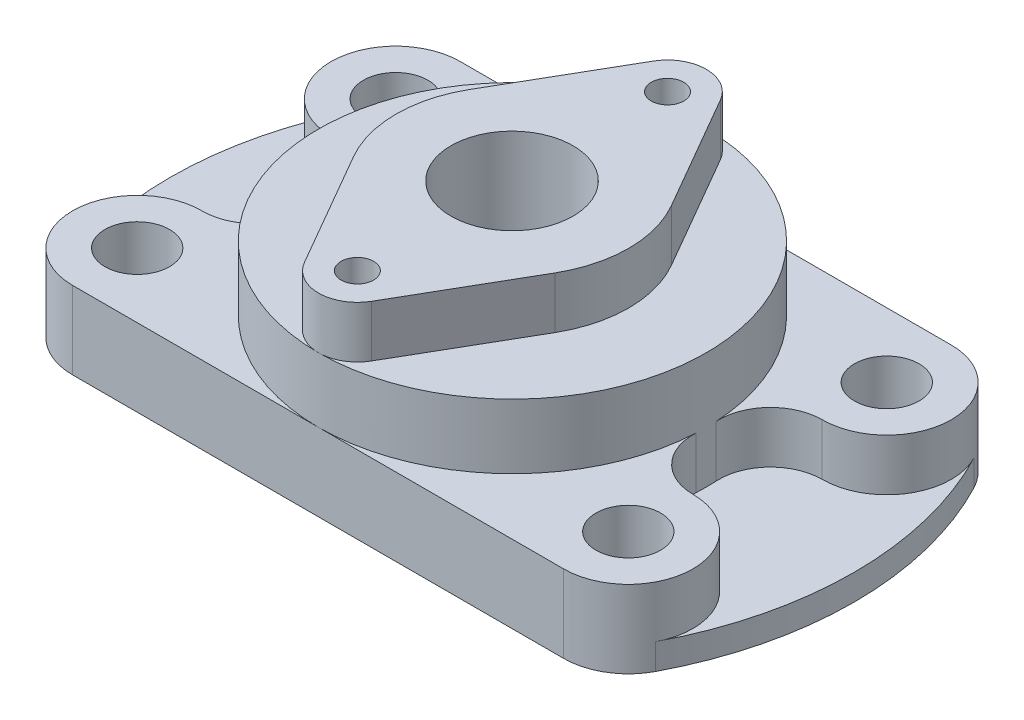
from build123d import *

# Parameters (mm, degrees)
BASE_EXTRUDE_DEPTH           = 3.175
BOSS_EXTRUDE1_DEPTH          = 9.525
SKETCH4_R                    = 23.8125
BOSS_EXTRUDE2_DEPTH          = 17.4625
BOSS_EXTRUDE3_DEPTH          = 23.8125
SKETCH8_R                    = 3.96875
CUT_EXTRUDE2_DEPTH           = 54.846660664
MIRROR2_COPY_1_SKETCH_R      = 3.96875
MIRROR2_COPY_1_DEPTH         = 54.846660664
F_15_0_15_DIAMETER_HOLE1_D   = 15
F_4_0_4_DIAMETER_HOLE1_D     = 4
F_4_0_4_DIAMETER_HOLE1_DEPTH = 10
F_4_0_4_DIAMETER_HOLE1_TIP   = 1.201721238


with BuildPart() as part:
    # Sketch2 → Base-Extrude (new body)
    with BuildSketch(Plane(origin=(0, 0, 0), x_dir=(1, 0, 0), z_dir=(0, 1, 0))):
        with BuildLine():
            Line((-30.1625, 23.8125), (30.1625, 23.8125))
            ThreePointArc((30.1625, 23.8125), (34.267360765, 22.668675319), (37.189168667, 19.566860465))
            ThreePointArc((37.189168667, 19.566860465), (42.016574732, 0), (37.189168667, -19.566860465))
            ThreePointArc((37.189168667, -19.566860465), (34.267360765, -22.668675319), (30.1625, -23.8125))
            Line((30.1625, -23.8125), (-30.1625, -23.8125))
            ThreePointArc((-30.1625, -23.8125), (-34.267360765, -22.668675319), (-37.189168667, -19.566860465))
            ThreePointArc((-37.189168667, -19.566860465), (-42.016574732, 0), (-37.189168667, 19.566860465))
            ThreePointArc((-37.189168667, 19.566860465), (-34.267360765, 22.668675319), (-30.1625, 23.8125))
        make_face()
    extrude(amount=BASE_EXTRUDE_DEPTH)

    # Sketch3 → Boss-Extrude1 (add)
    with BuildSketch(Plane(origin=(0, 0, 0), x_dir=(1, 0, 0), z_dir=(0, 1, 0))):
        with BuildLine():
            Line((-30.1625, 23.8125), (30.1625, 23.8125))
            ThreePointArc((30.1625, 23.8125), (38.099999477, 15.877880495), (30.168260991, 7.937502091))
            ThreePointArc((30.168260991, 7.937502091), (25.564509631, 5.956201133), (23.831670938, 1.253292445))
            ThreePointArc((23.831670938, 1.253292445), (23.864675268, 0), (23.831670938, -1.253292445))
            ThreePointArc((23.831670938, -1.253292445), (25.564509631, -5.956201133), (30.168260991, -7.937502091))
            ThreePointArc((30.168260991, -7.937502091), (38.099999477, -15.877880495), (30.1625, -23.8125))
            Line((30.1625, -23.8125), (-30.1625, -23.8125))
            ThreePointArc((-30.1625, -23.8125), (-38.099957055, -15.848889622), (-30.110279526, -7.93767178))
            ThreePointArc((-30.110279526, -7.93767178), (-25.476107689, -5.973285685), (-23.727307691, -1.253533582))
            ThreePointArc((-23.727307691, -1.253533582), (-23.760324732, 0), (-23.727307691, 1.253533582))
            ThreePointArc((-23.727307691, 1.253533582), (-25.476107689, 5.973285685), (-30.110279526, 7.93767178))
            ThreePointArc((-30.110279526, 7.93767178), (-38.099957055, 15.848889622), (-30.1625, 23.8125))
        make_face()
    extrude(amount=BOSS_EXTRUDE1_DEPTH)

    # Sketch4 → Boss-Extrude2 (add)
    with BuildSketch(Plane(origin=(0, 0, 0), x_dir=(1, 0, 0), z_dir=(0, 1, 0))):
        with Locations(Location((0.052175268, 0, 0), (0, 0, 270))):
            Circle(SKETCH4_R)
    extrude(amount=BOSS_EXTRUDE2_DEPTH)

    # Sketch5 → Boss-Extrude3 (add)
    with BuildSketch(Plane(origin=(0, 0, 0), x_dir=(1, 0, 0), z_dir=(0, 1, 0))):
        with BuildLine():
            Line((-12.321162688, 7.14375), (-4.072270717, 21.43125))
            ThreePointArc((-4.072270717, 21.43125), (0.052175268, 23.8125), (4.176621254, 21.43125))
            Line((4.176621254, 21.43125), (12.425513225, 7.14375))
            ThreePointArc((12.425513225, 7.14375), (14.339675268, 0), (12.425513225, -7.14375))
            Line((12.425513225, -7.14375), (4.176621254, -21.43125))
            ThreePointArc((4.176621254, -21.43125), (0.052175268, -23.8125), (-4.072270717, -21.43125))
            Line((-4.072270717, -21.43125), (-12.321162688, -7.14375))
            ThreePointArc((-12.321162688, -7.14375), (-14.235324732, 0), (-12.321162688, 7.14375))
        make_face()
    extrude(amount=BOSS_EXTRUDE3_DEPTH)

    # Sketch8 → Cut-Extrude2 (cut, through all)
    with BuildSketch(Plane(origin=(0, 0, 0), x_dir=(1, 0, 0), z_dir=(0, 1, 0))):
        with Locations(Location((-30.1625, -15.875, 0), (0, 0, 270))):
            Circle(SKETCH8_R)
    cut_extrude2 = extrude(amount=CUT_EXTRUDE2_DEPTH, mode=Mode.SUBTRACT)

    # Mirror1: Cut-Extrude2 across plane
    add(cut_extrude2.mirror(Plane.XY), mode=Mode.SUBTRACT)

    # Mirror2: Cut-Extrude2 across plane
    add(cut_extrude2.mirror(Plane(origin=(0, 0, 0), x_dir=(0, 0, 1), z_dir=(1, 0, 0))), mode=Mode.SUBTRACT)

    # Mirror2 copy 1 sketch → Mirror2 copy 1 (cut, through all)
    with BuildSketch(Plane(origin=(0, 0, 0), x_dir=(-1, 0, 0), z_dir=(0, 1, 0))):
        with Locations(Location((-30.1625, -15.875, 0), (0, 0, 270))):
            Circle(MIRROR2_COPY_1_SKETCH_R)
    extrude(amount=MIRROR2_COPY_1_DEPTH, mode=Mode.SUBTRACT)

    # 15.0 _15_ Diameter Hole1 (through all)
    with Locations(Plane(origin=(0, 23.8125, 0), x_dir=(-1, 0, 0), z_dir=(0, 1, 0))):
        with Locations((0, 0)):
            Hole(F_15_0_15_DIAMETER_HOLE1_D / 2)

    # 4.0 _4_ Diameter Hole1
    with Locations(Plane(origin=(0, 23.8125, 0), x_dir=(-1, 0, 0), z_dir=(0, 1, 0))):
        with Locations((-0.052175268, -19.05), (-0.052175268, 19.05)):
            Hole(F_4_0_4_DIAMETER_HOLE1_D / 2, depth=F_4_0_4_DIAMETER_HOLE1_DEPTH)
            with Locations((0, 0, -(F_4_0_4_DIAMETER_HOLE1_DEPTH + F_4_0_4_DIAMETER_HOLE1_TIP / 2))):  # 118° drill point
                Cone(0, F_4_0_4_DIAMETER_HOLE1_D / 2, F_4_0_4_DIAMETER_HOLE1_TIP, mode=Mode.SUBTRACT)


solid = part.part
